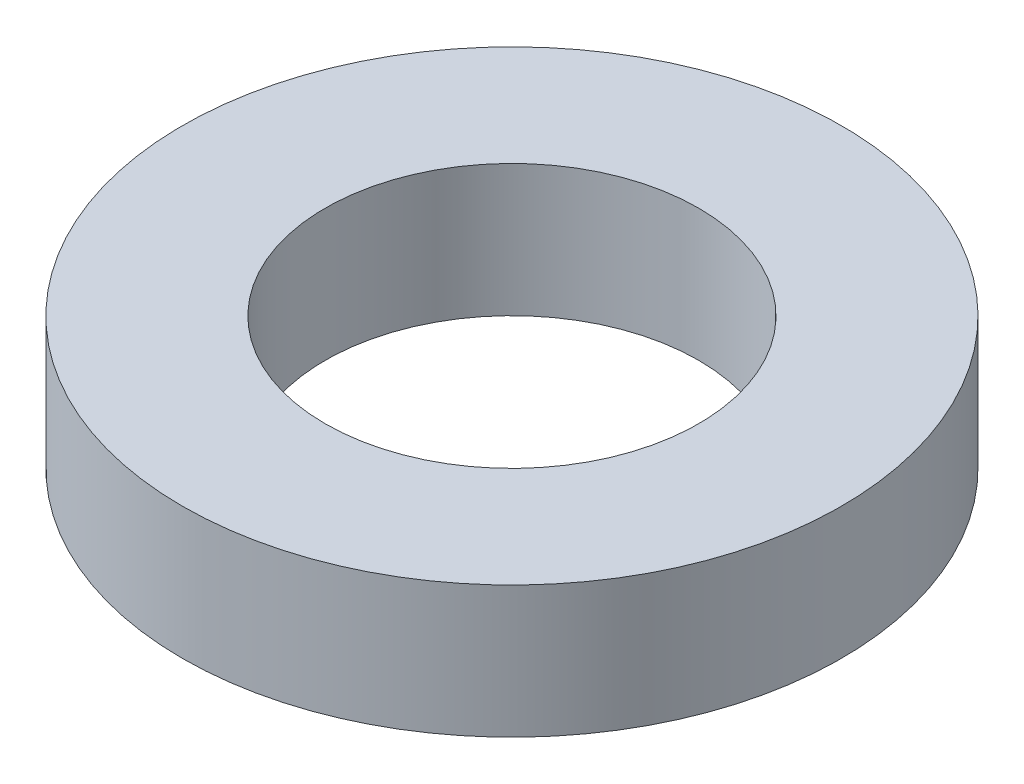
from build123d import *

# Parameters (mm, degrees)
SKETCH1_R           = 7.5
SKETCH1_R_2         = 4.25
BOSS_EXTRUDE1_DEPTH = 3


with BuildPart() as part:
    # Sketch1 → Boss-Extrude1 (new body)
    with BuildSketch(Plane(origin=(0, 0, 0), x_dir=(1, 0, 0), z_dir=(0, 1, 0))):
        with Locations(Location((0, 0, 0), (0, 0, 270))):
            Circle(SKETCH1_R)
        with Locations(Location((0, 0, 0), (0, 0, 270))):
            Circle(SKETCH1_R_2, mode=Mode.SUBTRACT)
    extrude(amount=BOSS_EXTRUDE1_DEPTH)


solid = part.part
